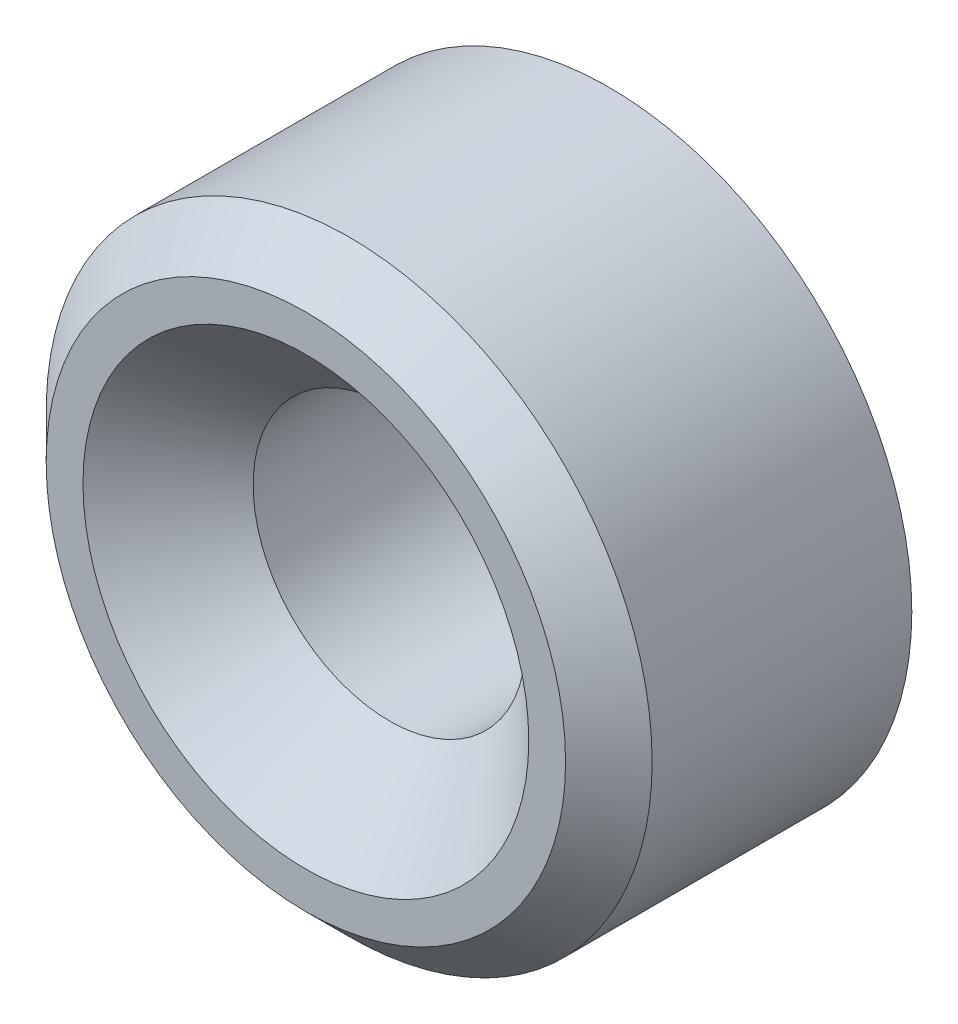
ISO-10303-21;
HEADER;
FILE_DESCRIPTION(('STEP AP214'),'2;1');
FILE_NAME('part.step','',(''),(''),'','','');
FILE_SCHEMA(('AUTOMOTIVE_DESIGN { 1 0 10303 214 1 1 1 1 }'));
ENDSEC;
DATA;
#1=APPLICATION_CONTEXT('core data for automotive mechanical design processes');
#2=APPLICATION_PROTOCOL_DEFINITION('international standard','automotive_design',2000,#1);
#3=PRODUCT_CONTEXT('',#1,'mechanical');
#4=PRODUCT('Part','Part','',(#3));
#5=PRODUCT_RELATED_PRODUCT_CATEGORY('part','',(#4));
#6=PRODUCT_DEFINITION_FORMATION('','',#4);
#7=PRODUCT_DEFINITION_CONTEXT('part definition',#1,'design');
#8=PRODUCT_DEFINITION('design','',#6,#7);
#9=PRODUCT_DEFINITION_SHAPE('','',#8);
#10=(LENGTH_UNIT() NAMED_UNIT(*) SI_UNIT(.MILLI.,.METRE.));
#11=(NAMED_UNIT(*) PLANE_ANGLE_UNIT() SI_UNIT($,.RADIAN.));
#12=(NAMED_UNIT(*) SI_UNIT($,.STERADIAN.) SOLID_ANGLE_UNIT());
#13=UNCERTAINTY_MEASURE_WITH_UNIT(LENGTH_MEASURE(1.E-05),#10,'distance_accuracy_value','');
#14=(GEOMETRIC_REPRESENTATION_CONTEXT(3) GLOBAL_UNCERTAINTY_ASSIGNED_CONTEXT((#13)) GLOBAL_UNIT_ASSIGNED_CONTEXT((#10,
#11,#12)) REPRESENTATION_CONTEXT('',''));
#15=CARTESIAN_POINT('',(0.,0.,0.));
#16=DIRECTION('',(0.,0.,1.));
#17=DIRECTION('',(1.,0.,0.));
#18=AXIS2_PLACEMENT_3D('',#15,#16,#17);
#19=CARTESIAN_POINT('',(0.,0.,7.00000000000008));
#20=DIRECTION('',(0.,0.,-1.));
#21=DIRECTION('',(-1.,0.,0.));
#22=AXIS2_PLACEMENT_3D('',#19,#20,#21);
#23=CYLINDRICAL_SURFACE('',#22,7.);
#24=CARTESIAN_POINT('',(0.,0.,6.00000000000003));
#25=DIRECTION('',(0.,0.,1.));
#26=DIRECTION('',(1.,0.,0.));
#27=AXIS2_PLACEMENT_3D('',#24,#25,#26);
#28=CIRCLE('',#27,7.);
#29=CARTESIAN_POINT('',(7.,0.,6.00000000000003));
#30=VERTEX_POINT('',#29);
#31=EDGE_CURVE('E10',#30,#30,#28,.F.);
#32=ORIENTED_EDGE('',*,*,#31,.T.);
#33=EDGE_LOOP('',(#32));
#34=FACE_BOUND('',#33,.T.);
#35=CARTESIAN_POINT('',(0.,0.,0.));
#36=DIRECTION('',(0.,0.,1.));
#37=DIRECTION('',(1.,0.,0.));
#38=AXIS2_PLACEMENT_3D('',#35,#36,#37);
#39=CIRCLE('',#38,7.);
#40=CARTESIAN_POINT('',(7.,0.,0.));
#41=VERTEX_POINT('',#40);
#42=EDGE_CURVE('E44',#41,#41,#39,.T.);
#43=ORIENTED_EDGE('',*,*,#42,.T.);
#44=EDGE_LOOP('',(#43));
#45=FACE_BOUND('',#44,.T.);
#46=ADVANCED_FACE('F33',(#34,#45),#23,.T.);
#47=CARTESIAN_POINT('',(0.,0.,7.00000000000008));
#48=DIRECTION('',(0.,0.,1.));
#49=DIRECTION('',(1.,0.,0.));
#50=AXIS2_PLACEMENT_3D('',#47,#48,#49);
#51=PLANE('',#50);
#52=CARTESIAN_POINT('',(0.,0.,7.00000000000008));
#53=DIRECTION('',(0.,0.,1.));
#54=DIRECTION('',(1.,0.,0.));
#55=AXIS2_PLACEMENT_3D('',#52,#53,#54);
#56=CIRCLE('',#55,5.15);
#57=CARTESIAN_POINT('',(5.15,0.,7.00000000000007));
#58=VERTEX_POINT('',#57);
#59=EDGE_CURVE('E57',#58,#58,#56,.T.);
#60=ORIENTED_EDGE('',*,*,#59,.F.);
#61=EDGE_LOOP('',(#60));
#62=FACE_BOUND('',#61,.T.);
#63=CARTESIAN_POINT('',(0.,0.,7.00000000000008));
#64=DIRECTION('',(0.,0.,1.));
#65=DIRECTION('',(1.,0.,0.));
#66=AXIS2_PLACEMENT_3D('',#63,#64,#65);
#67=CIRCLE('',#66,6.);
#68=CARTESIAN_POINT('',(6.,0.,7.00000000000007));
#69=VERTEX_POINT('',#68);
#70=EDGE_CURVE('E40',#69,#69,#67,.T.);
#71=ORIENTED_EDGE('',*,*,#70,.T.);
#72=EDGE_LOOP('',(#71));
#73=FACE_BOUND('',#72,.T.);
#74=ADVANCED_FACE('F63',(#62,#73),#51,.T.);
#75=CARTESIAN_POINT('',(0.,0.,0.));
#76=DIRECTION('',(0.,0.,1.));
#77=DIRECTION('',(1.,0.,0.));
#78=AXIS2_PLACEMENT_3D('',#75,#76,#77);
#79=PLANE('',#78);
#80=CARTESIAN_POINT('',(0.,0.,0.));
#81=DIRECTION('',(0.,0.,1.));
#82=DIRECTION('',(1.,0.,0.));
#83=AXIS2_PLACEMENT_3D('',#80,#81,#82);
#84=CIRCLE('',#83,3.15);
#85=CARTESIAN_POINT('',(3.15,0.,0.));
#86=VERTEX_POINT('',#85);
#87=EDGE_CURVE('E49',#86,#86,#84,.T.);
#88=ORIENTED_EDGE('',*,*,#87,.T.);
#89=EDGE_LOOP('',(#88));
#90=FACE_BOUND('',#89,.T.);
#91=ORIENTED_EDGE('',*,*,#42,.F.);
#92=EDGE_LOOP('',(#91));
#93=FACE_BOUND('',#92,.T.);
#94=ADVANCED_FACE('F65',(#90,#93),#79,.F.);
#95=CARTESIAN_POINT('',(0.,0.,7.00000000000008));
#96=DIRECTION('',(0.,0.,-1.));
#97=DIRECTION('',(-1.,0.,0.));
#98=AXIS2_PLACEMENT_3D('',#95,#96,#97);
#99=CONICAL_SURFACE('',#98,6.,0.785398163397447);
#100=ORIENTED_EDGE('',*,*,#31,.F.);
#101=EDGE_LOOP('',(#100));
#102=FACE_BOUND('',#101,.T.);
#103=ORIENTED_EDGE('',*,*,#70,.F.);
#104=EDGE_LOOP('',(#103));
#105=FACE_BOUND('',#104,.T.);
#106=ADVANCED_FACE('F35',(#102,#105),#99,.T.);
#107=CARTESIAN_POINT('',(0.,0.,7.00000000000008));
#108=DIRECTION('',(0.,0.,1.));
#109=DIRECTION('',(1.,0.,0.));
#110=AXIS2_PLACEMENT_3D('',#107,#108,#109);
#111=CYLINDRICAL_SURFACE('',#110,3.15);
#112=ORIENTED_EDGE('',*,*,#87,.F.);
#113=EDGE_LOOP('',(#112));
#114=FACE_BOUND('',#113,.T.);
#115=CARTESIAN_POINT('',(0.,0.,5.06862245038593));
#116=DIRECTION('',(0.,0.,1.));
#117=DIRECTION('',(1.,0.,0.));
#118=AXIS2_PLACEMENT_3D('',#115,#116,#117);
#119=CIRCLE('',#118,3.15);
#120=CARTESIAN_POINT('',(3.15,0.,5.06862245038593));
#121=VERTEX_POINT('',#120);
#122=EDGE_CURVE('E54',#121,#121,#119,.T.);
#123=ORIENTED_EDGE('',*,*,#122,.T.);
#124=EDGE_LOOP('',(#123));
#125=FACE_BOUND('',#124,.T.);
#126=ADVANCED_FACE('F74',(#114,#125),#111,.F.);
#127=CARTESIAN_POINT('',(0.,0.,7.00000000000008));
#128=DIRECTION('',(0.,0.,1.));
#129=DIRECTION('',(1.,0.,0.));
#130=AXIS2_PLACEMENT_3D('',#127,#128,#129);
#131=CONICAL_SURFACE('',#130,5.15,0.802851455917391);
#132=ORIENTED_EDGE('',*,*,#122,.F.);
#133=EDGE_LOOP('',(#132));
#134=FACE_BOUND('',#133,.T.);
#135=ORIENTED_EDGE('',*,*,#59,.T.);
#136=EDGE_LOOP('',(#135));
#137=FACE_BOUND('',#136,.T.);
#138=ADVANCED_FACE('F61',(#134,#137),#131,.F.);
#139=CLOSED_SHELL('',(#46,#74,#94,#106,#126,#138));
#140=MANIFOLD_SOLID_BREP('B2',#139);
#141=ADVANCED_BREP_SHAPE_REPRESENTATION('',(#18,#140),#14);
#142=SHAPE_DEFINITION_REPRESENTATION(#9,#141);
ENDSEC;
END-ISO-10303-21;
